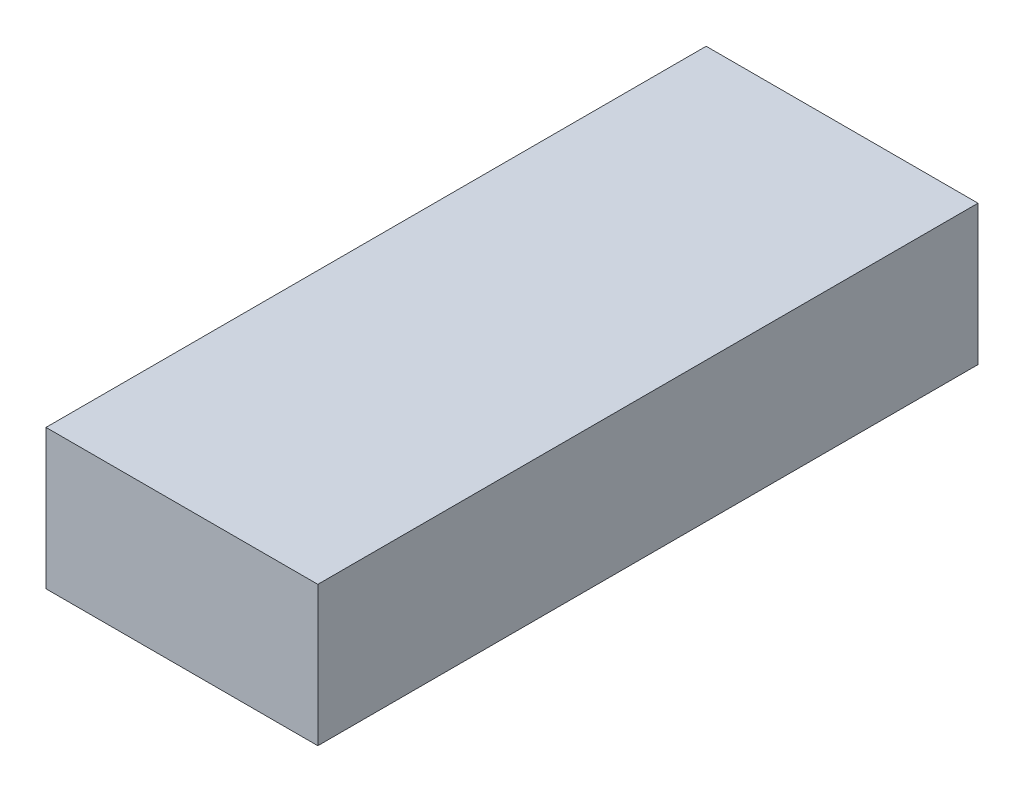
from build123d import *

# Parameters (mm, degrees)
SKETCH1_W           = 35
SKETCH1_H           = 85
BOSS_EXTRUDE1_DEPTH = 18


with BuildPart() as part:
    # Sketch1 → Boss-Extrude1 (new body)
    with BuildSketch(Plane(origin=(0, 0, 0), x_dir=(1, 0, 0), z_dir=(0, 1, 0))):
        Rectangle(SKETCH1_W, SKETCH1_H)
    extrude(amount=BOSS_EXTRUDE1_DEPTH)


solid = part.part
